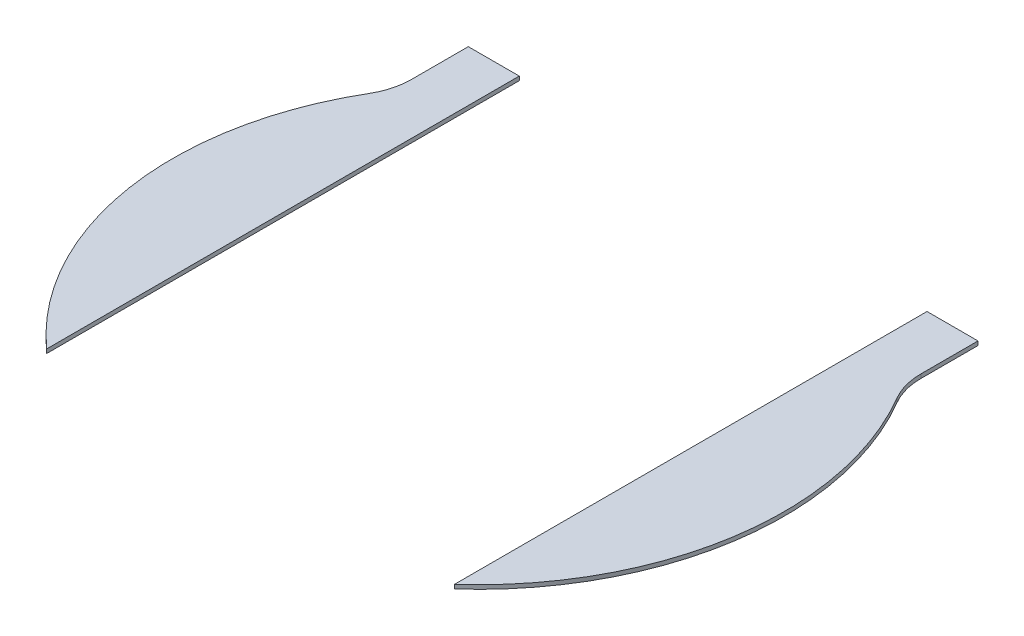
from build123d import *

# Parameters (mm, degrees)
EXTRUDE1_DEPTH   = 0.05
EXTRUDE1_2_DEPTH = 0.05


with BuildPart() as part:
    # Sketch1 → Extrude1 (new body)
    with BuildSketch(Plane(origin=(0, 0, 0), x_dir=(1, 0, 0), z_dir=(0, 1, 0))):
        with BuildLine():
            ThreePointArc((-3.286648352, 1.927185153), (-3.203408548, 2.125306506), (-3.175, 2.338317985))
            Line((-3.175, 2.338317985), (-3.175, 3.048))
            Line((-3.175, 3.048), (-2.54, 3.048))
            Line((-2.54, 3.048), (-2.54, -2.839806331))
            ThreePointArc((-2.54, -2.839806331), (-3.764108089, -0.589567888), (-3.286648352, 1.927185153))
        make_face()
    extrude(amount=EXTRUDE1_DEPTH)


with BuildPart() as body_2:
    # Sketch1 → Extrude1 2 (new body)
    with BuildSketch(Plane(origin=(0, 0, 0), x_dir=(1, 0, 0), z_dir=(0, 1, 0))):
        with BuildLine():
            ThreePointArc((3.175, 2.338317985), (3.203408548, 2.125306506), (3.286648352, 1.927185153))
            ThreePointArc((3.286648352, 1.927185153), (3.764108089, -0.589567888), (2.54, -2.839806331))
            Line((2.54, -2.839806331), (2.54, 3.048))
            Line((2.54, 3.048), (3.175, 3.048))
            Line((3.175, 3.048), (3.175, 2.338317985))
        make_face()
    extrude(amount=EXTRUDE1_2_DEPTH)


solid = Compound([part.part, body_2.part])
